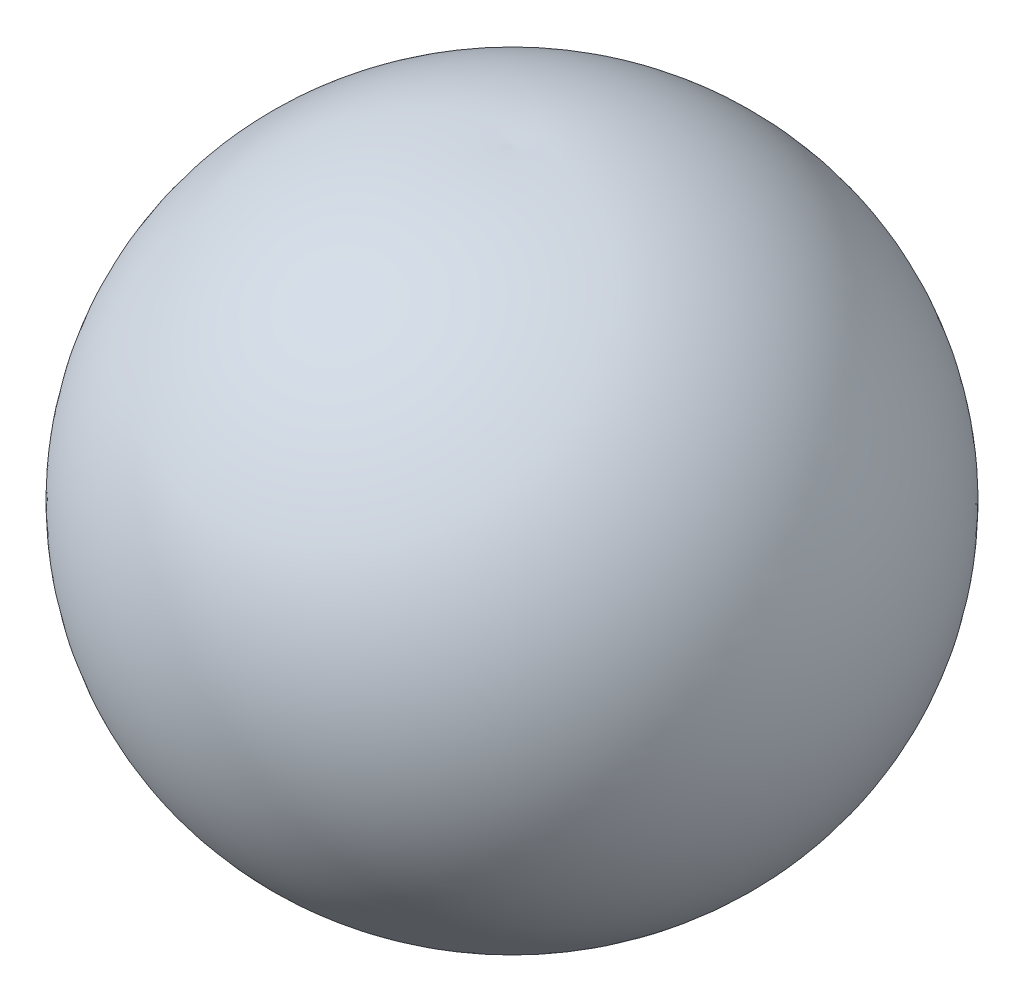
ISO-10303-21;
HEADER;
FILE_DESCRIPTION(('STEP AP214'),'2;1');
FILE_NAME('part.step','',(''),(''),'','','');
FILE_SCHEMA(('AUTOMOTIVE_DESIGN { 1 0 10303 214 1 1 1 1 }'));
ENDSEC;
DATA;
#1=APPLICATION_CONTEXT('core data for automotive mechanical design processes');
#2=APPLICATION_PROTOCOL_DEFINITION('international standard','automotive_design',2000,#1);
#3=PRODUCT_CONTEXT('',#1,'mechanical');
#4=PRODUCT('Part','Part','',(#3));
#5=PRODUCT_RELATED_PRODUCT_CATEGORY('part','',(#4));
#6=PRODUCT_DEFINITION_FORMATION('','',#4);
#7=PRODUCT_DEFINITION_CONTEXT('part definition',#1,'design');
#8=PRODUCT_DEFINITION('design','',#6,#7);
#9=PRODUCT_DEFINITION_SHAPE('','',#8);
#10=(LENGTH_UNIT() NAMED_UNIT(*) SI_UNIT(.MILLI.,.METRE.));
#11=(NAMED_UNIT(*) PLANE_ANGLE_UNIT() SI_UNIT($,.RADIAN.));
#12=(NAMED_UNIT(*) SI_UNIT($,.STERADIAN.) SOLID_ANGLE_UNIT());
#13=UNCERTAINTY_MEASURE_WITH_UNIT(LENGTH_MEASURE(1.E-05),#10,'distance_accuracy_value','');
#14=(GEOMETRIC_REPRESENTATION_CONTEXT(3) GLOBAL_UNCERTAINTY_ASSIGNED_CONTEXT((#13)) GLOBAL_UNIT_ASSIGNED_CONTEXT((#10,
#11,#12)) REPRESENTATION_CONTEXT('',''));
#15=CARTESIAN_POINT('',(0.,0.,0.));
#16=DIRECTION('',(0.,0.,1.));
#17=DIRECTION('',(1.,0.,0.));
#18=AXIS2_PLACEMENT_3D('',#15,#16,#17);
#19=CARTESIAN_POINT('',(0.,9.5,-0.616765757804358));
#20=DIRECTION('',(-1.,0.,0.));
#21=DIRECTION('',(0.,0.,-1.));
#22=AXIS2_PLACEMENT_3D('',#19,#20,#21);
#23=CIRCLE('',#22,9.52);
#24=TRIMMED_CURVE('',#23,(PARAMETER_VALUE(-1.635628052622)),(PARAMETER_VALUE(1.635628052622)),
.T.,.PARAMETER.);
#25=CARTESIAN_POINT('',(0.,9.5,0.));
#26=DIRECTION('',(0.,-1.,0.));
#27=AXIS1_PLACEMENT('',#25,#26);
#28=SURFACE_OF_REVOLUTION('',#24,#27);
#29=CARTESIAN_POINT('',(0.,0.,0.));
#30=VERTEX_POINT('',#29);
#31=VERTEX_LOOP('',#30);
#32=FACE_BOUND('',#31,.T.);
#33=CARTESIAN_POINT('',(0.,19.,0.));
#34=VERTEX_POINT('',#33);
#35=VERTEX_LOOP('',#34);
#36=FACE_BOUND('',#35,.T.);
#37=ADVANCED_FACE('F32',(#32,#36),#28,.T.);
#38=CLOSED_SHELL('',(#37));
#39=MANIFOLD_SOLID_BREP('B2',#38);
#40=ADVANCED_BREP_SHAPE_REPRESENTATION('',(#18,#39),#14);
#41=SHAPE_DEFINITION_REPRESENTATION(#9,#40);
ENDSEC;
END-ISO-10303-21;
